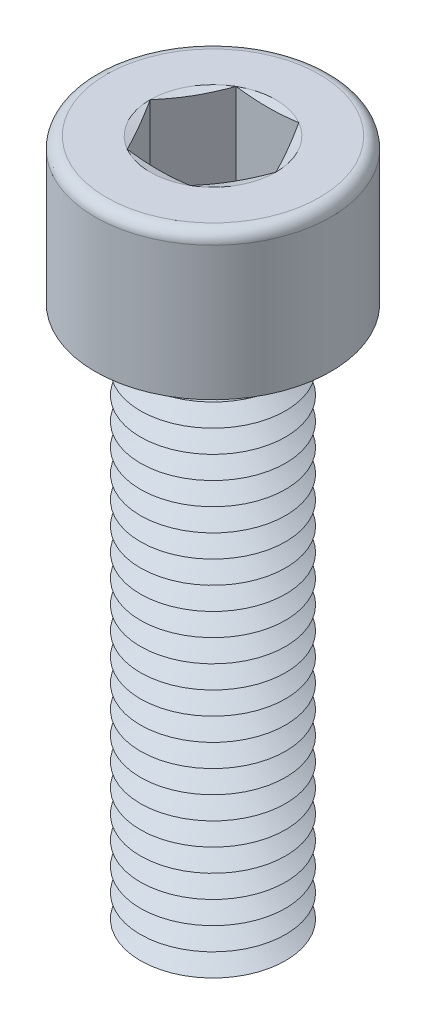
from build123d import *

# Parameters (mm, degrees)
SKETCH1_R       = 4
EXTRUDE1_DEPTH  = 30
SKETCH2_R       = 6.5
EXTRUDE2_DEPTH  = 8
EXTRUDE3_DEPTH  = 6
FILLET1_R       = 0.625
LPATTERN1_COUNT = 24
LPATTERN1_PITCH = 1.25


with BuildPart() as part:
    # Sketch1 → Extrude1 (new body)
    with BuildSketch(Plane(origin=(0, 0, 0), x_dir=(1, 0, 0), z_dir=(0, 1, 0))):
        with Locations(Location((0, 0, 0), (0, 0, 270))):
            Circle(SKETCH1_R)
    extrude(amount=EXTRUDE1_DEPTH)

    # Sketch2 → Extrude2 (add)
    with BuildSketch(Plane(origin=(0, 30, 0), x_dir=(1, 0, 0), z_dir=(0, 1, 0))):
        with Locations(Location((0, 0, 0), (0, 0, 270))):
            Circle(SKETCH2_R)
    extrude(amount=EXTRUDE2_DEPTH)

    # Sketch3 → Extrude3 (cut)
    with BuildSketch(Plane(origin=(0, 38, 0), x_dir=(1, 0, 0), z_dir=(0, 1, 0))):
        Polygon((1.732050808, 3), (-1.732050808, 3), (-3.464101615, 0), (-1.732050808, -3), (1.732050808, -3), (3.464101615, 0), align=None)
    extrude(amount=-EXTRUDE3_DEPTH, mode=Mode.SUBTRACT)

    # Fillet1
    fillet1_edges = [part.edges().sort_by_distance(p)[0] for p in [
        (0, 38, -6.5),
    ]]
    fillet(fillet1_edges, radius=FILLET1_R)

    # Sketch4 → Cut-Revolve1 (revolve, cut)
    with BuildSketch(Plane(origin=(0, 0, 0), x_dir=(0, 0, -1), z_dir=(1, 0, 0))):
        Polygon((-3, 32), (0, 32), (0, 30.267949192), align=None)
    revolve(axis=Axis((0, 32, 0), (0, -1, 0)), mode=Mode.SUBTRACT)

    # Sketch5 → Cut-Revolve2 (revolve, cut)
    with BuildSketch(Plane.XY, mode=Mode.PRIVATE) as cut_revolve2_sk:
        Polygon((-4, 0.625), (-4, -0.625), (-2.917468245, 0), align=None)
    cut_revolve2 = revolve(cut_revolve2_sk.sketch.rotate(Axis((0, 30, 0), (0, -1, 0)), 270), axis=Axis((0, 30, 0), (0, -1, 0)), mode=Mode.SUBTRACT)

    # LPattern1: Cut-Revolve2 ×24
    with Locations(*[(0, i * LPATTERN1_PITCH, 0) for i in range(1, LPATTERN1_COUNT)]):
        add(cut_revolve2, mode=Mode.SUBTRACT)

    # Extrude4 cone 1 section (on through the dimple's axis) → Extrude4 (revolve, cut)
    with BuildSketch(Plane(origin=(0, 38, 0), x_dir=(0, 0, 1), z_dir=(1, 0, 0))):
        Polygon((0, 0), (3.464101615, 0), (0, 0.92820323), align=None)
    revolve(axis=Axis((0, 38, 0), (0, -1, 0)), mode=Mode.SUBTRACT)


solid = part.part
